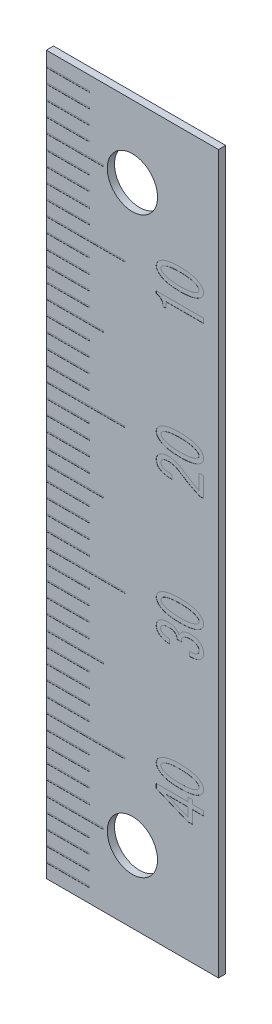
from build123d import *

# Parameters (mm, degrees)
SKETCH1_W      = 12
SKETCH1_H      = 50
EXTRUDE1_DEPTH = 0.5
SKETCH2_R      = 1.75
EXTRUDE2_DEPTH = 52.42227144
EXTRUDE3_DEPTH = 0.01
SKETCH4_W      = 3
SKETCH4_H      = 0.1
SKETCH4_W_2    = 4
SKETCH4_W_3    = 5.5
EXTRUDE4_DEPTH = 0.01


with BuildPart() as part:
    # Sketch1 → Extrude1 (new body)
    with BuildSketch(Plane.XY):
        with Locations((6, 25)):
            Rectangle(SKETCH1_W, SKETCH1_H)
    extrude(amount=EXTRUDE1_DEPTH)

    # Sketch2 → Extrude2 (cut, through all)
    with BuildSketch(Plane.XY.offset(0.5)):
        with Locations((6, 5)):
            Circle(SKETCH2_R)
        with Locations((6, 45)):
            Circle(SKETCH2_R)
    extrude(amount=-EXTRUDE2_DEPTH, mode=Mode.SUBTRACT)

    # Sketch3 → Extrude3 (cut)
    # profile 1 of 8: a face of its own
    with BuildSketch(Plane.XY.offset(0.5)):
        with BuildLine():
            Line((10.964202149, 38.983541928), (9.643449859, 38.983541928))
            Line((9.643449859, 38.983541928), (8.334630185, 38.983541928))
            Line((8.334630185, 38.983541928), (8.334630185, 38.58788147))
            Line((8.334630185, 38.58788147), (8.134287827, 38.58788147))
            add(Edge.make_bspline(
                [(8.134287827, 38.58788147), (8.133949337, 38.607154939), (8.133292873, 38.644533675), (8.127537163, 38.699138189), (8.117992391, 38.750485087), (8.105914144, 38.79930573), (8.088535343, 38.844454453), (8.068559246, 38.887235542), (8.044100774, 38.926478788), (8.016032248, 38.962796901), (7.984633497, 38.996211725), (7.949221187, 39.026469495), (7.910057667, 39.053561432), (7.867120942, 39.077453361), (7.820438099, 39.09818504), (7.770182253, 39.115604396), (7.716225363, 39.130205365), (7.67880858, 39.137442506), (7.659495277, 39.141178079)],
                knots=[0, 0, 0, 0, 1.144858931, 2.220325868, 3.257124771, 4.246590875, 5.202985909, 6.126465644, 7.048017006, 7.94360395, 8.849836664, 9.767181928, 10.705616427, 11.674465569, 12.68221077, 13.736395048, 14.831602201, 16, 16, 16, 16], degree=3))
            Line((7.659495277, 39.141178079), (7.659495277, 39.303210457))
            Line((7.659495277, 39.303210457), (10.964202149, 39.303210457))
            Line((10.964202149, 39.303210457), (10.964202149, 38.983541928))
        make_face()
    # profile 2 of 8: a face of its own
    with BuildSketch(Plane.XY.offset(0.5)):
        with BuildLine():
            add(Edge.make_bspline(
                [(9.304312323, 40.08636695), (9.263487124, 40.086598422), (9.183284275, 40.087053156), (9.065184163, 40.090916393), (8.951677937, 40.097059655), (8.842790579, 40.105920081), (8.738418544, 40.116877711), (8.638826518, 40.131643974), (8.543659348, 40.147711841), (8.453367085, 40.166540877), (8.367534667, 40.187646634), (8.286660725, 40.212475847), (8.209981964, 40.238496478), (8.13792646, 40.267351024), (8.071052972, 40.299483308), (8.008231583, 40.333293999), (7.950513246, 40.370357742), (7.914537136, 40.397244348), (7.896891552, 40.410431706)],
                knots=[0, 0, 0, 0, 1.334199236, 2.621091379, 3.861325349, 5.048806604, 6.191184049, 7.29033474, 8.338632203, 9.344988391, 10.304094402, 11.226124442, 12.10888774, 12.949942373, 13.760906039, 14.53244093, 15.280190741, 16, 16, 16, 16], degree=3))
            add(Edge.make_bspline(
                [(7.896891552, 40.410431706), (7.877886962, 40.425936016), (7.841081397, 40.455962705), (7.793642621, 40.506288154), (7.75209867, 40.556343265), (7.718531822, 40.608467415), (7.691781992, 40.661574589), (7.673561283, 40.716630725), (7.661657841, 40.77250316), (7.660214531, 40.810429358), (7.659495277, 40.829329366)],
                knots=[0, 0, 0, 0, 1.179273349, 2.283859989, 3.322502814, 4.306324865, 5.261663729, 6.17616916, 7.091118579, 8, 8, 8, 8], degree=3))
            add(Edge.make_bspline(
                [(7.659495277, 40.829329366), (7.660212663, 40.848230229), (7.661652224, 40.886158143), (7.67358392, 40.942017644), (7.691636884, 40.996945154), (7.718688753, 41.049705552), (7.752296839, 41.101723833), (7.793217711, 41.152330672), (7.841340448, 41.202029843), (7.877935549, 41.232049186), (7.896891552, 41.247598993)],
                knots=[0, 0, 0, 0, 0.909839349, 1.825753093, 2.741222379, 3.688535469, 4.673394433, 5.720979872, 6.819483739, 8, 8, 8, 8], degree=3))
            add(Edge.make_bspline(
                [(7.896891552, 41.247598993), (7.914537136, 41.260786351), (7.950513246, 41.287672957), (8.008231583, 41.3247367), (8.071052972, 41.358547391), (8.13792646, 41.390679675), (8.209981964, 41.419534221), (8.286660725, 41.445554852), (8.367534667, 41.470384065), (8.453367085, 41.491489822), (8.543659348, 41.510318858), (8.638826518, 41.526386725), (8.738418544, 41.541152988), (8.842790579, 41.552110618), (8.951677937, 41.560971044), (9.065184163, 41.567114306), (9.183284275, 41.570977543), (9.263487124, 41.571432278), (9.304312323, 41.571663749)],
                knots=[0, 0, 0, 0, 0.719809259, 1.46755907, 2.239093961, 3.050057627, 3.89111226, 4.773875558, 5.695905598, 6.655011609, 7.661367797, 8.70966526, 9.808815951, 10.951193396, 12.138674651, 13.378908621, 14.665800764, 16, 16, 16, 16], degree=3))
            add(Edge.make_bspline(
                [(9.304312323, 41.571663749), (9.345974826, 41.571432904), (9.427642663, 41.570980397), (9.547627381, 41.567132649), (9.662805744, 41.560946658), (9.773365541, 41.552091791), (9.879218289, 41.541255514), (9.980042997, 41.52631378), (10.076267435, 41.510328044), (10.167806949, 41.49146689), (10.25471717, 41.470480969), (10.336402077, 41.445542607), (10.413707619, 41.419531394), (10.486394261, 41.390685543), (10.553875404, 41.358519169), (10.617234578, 41.324907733), (10.675058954, 41.28765614), (10.711041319, 41.260780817), (10.728689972, 41.247598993)],
                knots=[0, 0, 0, 0, 1.346341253, 2.639130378, 3.8790076, 5.073442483, 6.223226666, 7.316783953, 8.366697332, 9.375051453, 10.336565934, 11.254764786, 12.134057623, 12.971986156, 13.779994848, 14.548849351, 15.288238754, 16, 16, 16, 16], degree=3))
            add(Edge.make_bspline(
                [(10.728689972, 41.247598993), (10.747351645, 41.231964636), (10.783604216, 41.201592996), (10.832476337, 41.152791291), (10.872490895, 41.101447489), (10.906527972, 41.049937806), (10.932289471, 40.996615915), (10.951811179, 40.942259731), (10.962410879, 40.886054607), (10.964024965, 40.848209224), (10.964830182, 40.829329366)],
                knots=[0, 0, 0, 0, 1.1743338, 2.28128622, 3.323893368, 4.309986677, 5.254013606, 6.173907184, 7.08902033, 8, 8, 8, 8], degree=3))
            add(Edge.make_bspline(
                [(10.964830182, 40.829329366), (10.964023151, 40.81045032), (10.962405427, 40.772606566), (10.95183315, 40.716389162), (10.932141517, 40.661902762), (10.906685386, 40.608236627), (10.872691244, 40.556620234), (10.832051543, 40.505827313), (10.783860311, 40.456400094), (10.747399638, 40.426020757), (10.728689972, 40.410431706)],
                knots=[0, 0, 0, 0, 0.910025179, 1.824179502, 2.743109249, 3.69522398, 4.680284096, 5.713901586, 6.826896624, 8, 8, 8, 8], degree=3))
            add(Edge.make_bspline(
                [(10.728689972, 40.410431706), (10.711041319, 40.397249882), (10.675058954, 40.370374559), (10.617234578, 40.333122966), (10.553875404, 40.29951153), (10.486394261, 40.267345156), (10.413707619, 40.238499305), (10.336402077, 40.212488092), (10.25471717, 40.18754973), (10.167806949, 40.166563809), (10.076267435, 40.147702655), (9.980042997, 40.131716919), (9.879218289, 40.116775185), (9.773365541, 40.105938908), (9.662805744, 40.097084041), (9.547627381, 40.09089805), (9.427642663, 40.087050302), (9.345974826, 40.086597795), (9.304312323, 40.08636695)],
                knots=[0, 0, 0, 0, 0.711761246, 1.451150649, 2.220005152, 3.028013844, 3.865942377, 4.745235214, 5.663434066, 6.624948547, 7.633302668, 8.683216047, 9.776773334, 10.926557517, 12.1209924, 13.360869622, 14.653658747, 16, 16, 16, 16], degree=3))
        make_face()
        with BuildLine():
            add(Edge.make_bspline(
                [(9.304312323, 41.261415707), (9.267676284, 41.261069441), (9.195861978, 41.260390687), (9.090316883, 41.258165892), (8.989150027, 41.253278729), (8.892481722, 41.245290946), (8.80022693, 41.237179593), (8.712814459, 41.225295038), (8.629718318, 41.213328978), (8.551258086, 41.197943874), (8.47692929, 41.181420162), (8.407398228, 41.16150603), (8.341873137, 41.141413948), (8.281453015, 41.117852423), (8.225379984, 41.092883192), (8.173815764, 41.065786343), (8.126168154, 41.037204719), (8.097468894, 41.015283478), (8.083417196, 41.004550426)],
                knots=[0, 0, 0, 0, 1.387476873, 2.71974516, 3.997715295, 5.222316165, 6.392993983, 7.5041764, 8.562605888, 9.571696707, 10.531368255, 11.445041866, 12.310057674, 13.125709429, 13.899281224, 14.633331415, 15.330853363, 16, 16, 16, 16], degree=3))
            add(Edge.make_bspline(
                [(8.083417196, 41.004550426), (8.067942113, 40.991309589), (8.038992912, 40.966539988), (8.006840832, 40.922559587), (7.985224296, 40.87705391), (7.982844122, 40.845041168), (7.981675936, 40.829329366)],
                knots=[0, 0, 0, 0, 1.162721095, 2.175099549, 3.10434177, 4, 4, 4, 4], degree=3))
            add(Edge.make_bspline(
                [(7.981675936, 40.829329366), (7.982836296, 40.813611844), (7.985200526, 40.781587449), (8.007018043, 40.736019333), (8.038753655, 40.691521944), (8.067903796, 40.666693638), (8.083417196, 40.653480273)],
                knots=[0, 0, 0, 0, 0.893494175, 1.820491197, 2.840088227, 4, 4, 4, 4], degree=3))
            add(Edge.make_bspline(
                [(8.083417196, 40.653480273), (8.098156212, 40.643035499), (8.128454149, 40.621564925), (8.177291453, 40.592299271), (8.230299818, 40.565060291), (8.287887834, 40.540907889), (8.349363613, 40.517529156), (8.415145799, 40.496237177), (8.485227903, 40.477516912), (8.559390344, 40.460570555), (8.637959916, 40.445608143), (8.720652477, 40.432335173), (8.807623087, 40.421817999), (8.898748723, 40.413272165), (8.994176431, 40.405404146), (9.093874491, 40.400498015), (9.197746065, 40.398267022), (9.268304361, 40.397589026), (9.304312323, 40.397243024)],
                knots=[0, 0, 0, 0, 0.684573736, 1.407229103, 2.156074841, 2.941731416, 3.772993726, 4.648817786, 5.561264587, 6.521855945, 7.531913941, 8.592575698, 9.69595549, 10.851956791, 12.06190895, 13.325252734, 14.634998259, 16, 16, 16, 16], degree=3))
            add(Edge.make_bspline(
                [(9.304312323, 40.397243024), (9.341785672, 40.397588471), (9.415065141, 40.398263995), (9.522703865, 40.400490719), (9.625541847, 40.405385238), (9.723691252, 40.413273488), (9.817323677, 40.421841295), (9.906404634, 40.432229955), (9.990753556, 40.445635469), (10.070391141, 40.460491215), (10.145369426, 40.477539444), (10.215901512, 40.496147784), (10.281702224, 40.517419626), (10.342729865, 40.540898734), (10.399661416, 40.565104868), (10.451853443, 40.591966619), (10.49904188, 40.621590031), (10.528053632, 40.643045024), (10.542164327, 40.653480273)],
                knots=[0, 0, 0, 0, 1.401046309, 2.739758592, 4.0248449, 5.249399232, 6.420696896, 7.540008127, 8.601571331, 9.613140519, 10.568176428, 11.475655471, 12.339456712, 13.151990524, 13.919674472, 14.651282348, 15.344012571, 16, 16, 16, 16], degree=3))
            add(Edge.make_bspline(
                [(10.542164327, 40.653480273), (10.557596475, 40.666746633), (10.586687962, 40.691755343), (10.619429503, 40.735654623), (10.640196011, 40.781762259), (10.642682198, 40.813642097), (10.643905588, 40.829329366)],
                knots=[0, 0, 0, 0, 1.159232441, 2.18529495, 3.107029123, 4, 4, 4, 4], degree=3))
            add(Edge.make_bspline(
                [(10.643905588, 40.829329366), (10.642674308, 40.845010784), (10.640172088, 40.876878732), (10.619603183, 40.922925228), (10.586449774, 40.966304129), (10.557558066, 40.991255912), (10.542164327, 41.004550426)],
                knots=[0, 0, 0, 0, 0.89511734, 1.819067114, 2.837981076, 4, 4, 4, 4], degree=3))
            add(Edge.make_bspline(
                [(10.542164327, 41.004550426), (10.528109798, 41.015278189), (10.499404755, 41.037188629), (10.45164342, 41.065951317), (10.399548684, 41.092855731), (10.342868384, 41.117856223), (10.281814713, 41.14140776), (10.215668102, 41.161504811), (10.14550559, 41.181409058), (10.070358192, 41.198018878), (9.990830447, 41.213306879), (9.906283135, 41.225349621), (9.817389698, 41.237124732), (9.72367965, 41.245296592), (9.625545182, 41.253298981), (9.522702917, 41.258160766), (9.415065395, 41.26039668), (9.341785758, 41.261070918), (9.304312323, 41.261415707)],
                knots=[0, 0, 0, 0, 0.660466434, 1.348940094, 2.080407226, 2.851088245, 3.663465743, 4.524722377, 5.434082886, 6.388935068, 7.400309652, 8.46048529, 9.580538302, 10.751610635, 11.975929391, 13.260768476, 14.599223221, 16, 16, 16, 16], degree=3))
        make_face(mode=Mode.SUBTRACT)
    # profile 3 of 8: a face of its own
    with BuildSketch(Plane.XY.offset(0.5)):
        with BuildLine():
            Line((10.643905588, 29.789307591), (10.964830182, 29.789307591))
            Line((10.964830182, 29.789307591), (10.964830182, 28.412032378))
            Line((10.964830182, 28.412032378), (10.694776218, 28.412032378))
            add(Edge.make_bspline(
                [(10.694776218, 28.412032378), (10.634104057, 28.438239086), (10.512820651, 28.490626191), (10.333941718, 28.576059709), (10.15666089, 28.664824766), (9.982086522, 28.759401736), (9.809323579, 28.858008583), (9.638392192, 28.960822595), (9.469988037, 29.068963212), (9.359615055, 29.144268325), (9.304312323, 29.18200019)],
                knots=[0, 0, 0, 0, 0.99614483, 1.991289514, 2.987624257, 3.984438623, 4.983697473, 5.985971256, 6.990864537, 8, 8, 8, 8], degree=3))
            add(Edge.make_bspline(
                [(9.304312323, 29.18200019), (9.273407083, 29.202561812), (9.212458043, 29.24311193), (9.117211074, 29.295150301), (9.021104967, 29.339278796), (8.923672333, 29.375332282), (8.825440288, 29.4035815), (8.72593849, 29.42388529), (8.625513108, 29.436178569), (8.558034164, 29.437551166), (8.524295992, 29.438237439)],
                knots=[0, 0, 0, 0, 1.067918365, 2.106070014, 3.119789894, 4.109153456, 5.093164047, 6.058534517, 7.029304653, 8, 8, 8, 8], degree=3))
            add(Edge.make_bspline(
                [(8.524295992, 29.438237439), (8.501046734, 29.437894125), (8.455732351, 29.437224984), (8.389860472, 29.431518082), (8.328132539, 29.422267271), (8.270797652, 29.409104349), (8.21743613, 29.392320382), (8.168710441, 29.370724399), (8.123431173, 29.346637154), (8.096599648, 29.326782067), (8.083417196, 29.317027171)],
                knots=[0, 0, 0, 0, 1.197973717, 2.334932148, 3.404529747, 4.412096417, 5.3640046, 6.281988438, 7.155932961, 8, 8, 8, 8], degree=3))
            add(Edge.make_bspline(
                [(8.083417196, 29.317027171), (8.067746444, 29.303076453), (8.037248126, 29.275925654), (8.005254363, 29.223199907), (7.984772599, 29.164442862), (7.982726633, 29.122515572), (7.981675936, 29.100984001)],
                knots=[0, 0, 0, 0, 1.01321699, 1.971916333, 2.958486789, 4, 4, 4, 4], degree=3))
            add(Edge.make_bspline(
                [(7.981675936, 29.100984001), (7.983585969, 29.082717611), (7.987575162, 29.044567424), (8.01537348, 28.988943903), (8.059276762, 28.934674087), (8.097036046, 28.902326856), (8.11733095, 28.88494083)],
                knots=[0, 0, 0, 0, 0.831770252, 1.737190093, 2.783782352, 4, 4, 4, 4], degree=3))
            add(Edge.make_bspline(
                [(8.11733095, 28.88494083), (8.13152823, 28.875101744), (8.161915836, 28.854042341), (8.215884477, 28.829594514), (8.27953563, 28.808918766), (8.353234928, 28.792609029), (8.436819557, 28.778578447), (8.530630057, 28.769762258), (8.63433812, 28.764032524), (8.706835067, 28.763421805), (8.74473539, 28.76310253)],
                knots=[0, 0, 0, 0, 0.638255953, 1.36611168, 2.182006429, 3.11234378, 4.156826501, 5.317109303, 6.597424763, 8, 8, 8, 8], degree=3))
            Line((8.74473539, 28.76310253), (8.74473539, 28.466043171))
            add(Edge.make_bspline(
                [(8.74473539, 28.466043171), (8.695515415, 28.46790543), (8.600702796, 28.471492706), (8.463728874, 28.483794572), (8.337426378, 28.503038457), (8.221668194, 28.528812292), (8.116016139, 28.559516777), (8.021404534, 28.598268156), (7.936291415, 28.64179784), (7.886844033, 28.67828985), (7.862977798, 28.695903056)],
                knots=[0, 0, 0, 0, 1.276449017, 2.458828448, 3.562299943, 4.585123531, 5.530965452, 6.409552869, 7.23235602, 8, 8, 8, 8], degree=3))
            add(Edge.make_bspline(
                [(7.862977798, 28.695903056), (7.846729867, 28.709564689), (7.814699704, 28.736496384), (7.773183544, 28.782576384), (7.738532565, 28.832204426), (7.708926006, 28.884437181), (7.687412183, 28.940944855), (7.67065538, 29.000105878), (7.661233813, 29.063001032), (7.660084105, 29.105978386), (7.659495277, 29.127989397)],
                knots=[0, 0, 0, 0, 1.027969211, 2.026474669, 2.994832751, 3.957646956, 4.927969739, 5.917517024, 6.933448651, 8, 8, 8, 8], degree=3))
            add(Edge.make_bspline(
                [(7.659495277, 29.127989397), (7.659956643, 29.148979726), (7.660867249, 29.190408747), (7.672379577, 29.250967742), (7.688861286, 29.309450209), (7.71397118, 29.364787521), (7.74481477, 29.418042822), (7.782906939, 29.468678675), (7.828294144, 29.516390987), (7.862484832, 29.545314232), (7.879934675, 29.560075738)],
                knots=[0, 0, 0, 0, 1.000230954, 1.974175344, 2.932001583, 3.893571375, 4.865053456, 5.864036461, 6.909871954, 8, 8, 8, 8], degree=3))
            add(Edge.make_bspline(
                [(7.879934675, 29.560075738), (7.900321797, 29.575446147), (7.941611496, 29.606575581), (8.010569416, 29.644342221), (8.084899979, 29.676515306), (8.164800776, 29.703727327), (8.25083857, 29.724143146), (8.34261768, 29.738396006), (8.43996472, 29.747294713), (8.506900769, 29.748496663), (8.541252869, 29.749113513)],
                knots=[0, 0, 0, 0, 0.873404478, 1.768891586, 2.683909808, 3.645167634, 4.655436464, 5.707963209, 6.823708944, 8, 8, 8, 8], degree=3))
            add(Edge.make_bspline(
                [(8.541252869, 29.749113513), (8.5825466, 29.747997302), (8.665684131, 29.745750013), (8.7908176, 29.728176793), (8.916613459, 29.69873904), (9.043909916, 29.659401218), (9.171696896, 29.607206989), (9.300597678, 29.544064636), (9.430892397, 29.470149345), (9.515481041, 29.41326659), (9.558665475, 29.384226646)],
                knots=[0, 0, 0, 0, 0.902713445, 1.817451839, 2.756860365, 3.725448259, 4.727634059, 5.771721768, 6.862413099, 8, 8, 8, 8], degree=3))
            add(Edge.make_bspline(
                [(9.558665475, 29.384226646), (9.650692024, 29.32107194), (9.831341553, 29.197098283), (10.105692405, 29.027797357), (10.37414261, 28.87223849), (10.555117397, 28.780905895), (10.643905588, 28.736097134)],
                knots=[0, 0, 0, 0, 1.058433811, 2.077721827, 3.056909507, 4, 4, 4, 4], degree=3))
            Line((10.643905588, 28.736097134), (10.643905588, 29.789307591))
        make_face()
    # profile 4 of 8: a face of its own
    with BuildSketch(Plane.XY.offset(0.5)):
        with BuildLine():
            add(Edge.make_bspline(
                [(9.304312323, 30.08636695), (9.263487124, 30.086598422), (9.183284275, 30.087053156), (9.065184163, 30.090916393), (8.951677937, 30.097059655), (8.842790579, 30.105920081), (8.738418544, 30.116877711), (8.638826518, 30.131643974), (8.543659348, 30.147711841), (8.453367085, 30.166540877), (8.367534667, 30.187646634), (8.286660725, 30.212475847), (8.209981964, 30.238496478), (8.13792646, 30.267351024), (8.071052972, 30.299483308), (8.008231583, 30.333293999), (7.950513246, 30.370357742), (7.914537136, 30.397244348), (7.896891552, 30.410431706)],
                knots=[0, 0, 0, 0, 1.334199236, 2.621091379, 3.861325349, 5.048806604, 6.191184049, 7.29033474, 8.338632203, 9.344988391, 10.304094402, 11.226124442, 12.10888774, 12.949942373, 13.760906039, 14.53244093, 15.280190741, 16, 16, 16, 16], degree=3))
            add(Edge.make_bspline(
                [(7.896891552, 30.410431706), (7.877886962, 30.425936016), (7.841081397, 30.455962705), (7.793642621, 30.506288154), (7.75209867, 30.556343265), (7.718531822, 30.608467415), (7.691781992, 30.661574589), (7.673561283, 30.716630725), (7.661657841, 30.77250316), (7.660214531, 30.810429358), (7.659495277, 30.829329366)],
                knots=[0, 0, 0, 0, 1.179273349, 2.283859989, 3.322502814, 4.306324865, 5.261663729, 6.17616916, 7.091118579, 8, 8, 8, 8], degree=3))
            add(Edge.make_bspline(
                [(7.659495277, 30.829329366), (7.660212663, 30.848230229), (7.661652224, 30.886158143), (7.67358392, 30.942017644), (7.691636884, 30.996945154), (7.718688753, 31.049705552), (7.752296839, 31.101723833), (7.793217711, 31.152330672), (7.841340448, 31.202029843), (7.877935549, 31.232049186), (7.896891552, 31.247598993)],
                knots=[0, 0, 0, 0, 0.909839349, 1.825753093, 2.741222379, 3.688535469, 4.673394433, 5.720979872, 6.819483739, 8, 8, 8, 8], degree=3))
            add(Edge.make_bspline(
                [(7.896891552, 31.247598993), (7.914537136, 31.260786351), (7.950513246, 31.287672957), (8.008231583, 31.3247367), (8.071052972, 31.358547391), (8.13792646, 31.390679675), (8.209981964, 31.419534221), (8.286660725, 31.445554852), (8.367534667, 31.470384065), (8.453367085, 31.491489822), (8.543659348, 31.510318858), (8.638826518, 31.526386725), (8.738418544, 31.541152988), (8.842790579, 31.552110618), (8.951677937, 31.560971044), (9.065184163, 31.567114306), (9.183284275, 31.570977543), (9.263487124, 31.571432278), (9.304312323, 31.571663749)],
                knots=[0, 0, 0, 0, 0.719809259, 1.46755907, 2.239093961, 3.050057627, 3.89111226, 4.773875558, 5.695905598, 6.655011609, 7.661367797, 8.70966526, 9.808815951, 10.951193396, 12.138674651, 13.378908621, 14.665800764, 16, 16, 16, 16], degree=3))
            add(Edge.make_bspline(
                [(9.304312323, 31.571663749), (9.345974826, 31.571432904), (9.427642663, 31.570980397), (9.547627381, 31.567132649), (9.662805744, 31.560946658), (9.773365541, 31.552091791), (9.879218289, 31.541255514), (9.980042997, 31.52631378), (10.076267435, 31.510328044), (10.167806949, 31.49146689), (10.25471717, 31.470480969), (10.336402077, 31.445542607), (10.413707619, 31.419531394), (10.486394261, 31.390685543), (10.553875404, 31.358519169), (10.617234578, 31.324907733), (10.675058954, 31.28765614), (10.711041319, 31.260780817), (10.728689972, 31.247598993)],
                knots=[0, 0, 0, 0, 1.346341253, 2.639130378, 3.8790076, 5.073442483, 6.223226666, 7.316783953, 8.366697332, 9.375051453, 10.336565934, 11.254764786, 12.134057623, 12.971986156, 13.779994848, 14.548849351, 15.288238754, 16, 16, 16, 16], degree=3))
            add(Edge.make_bspline(
                [(10.728689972, 31.247598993), (10.747351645, 31.231964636), (10.783604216, 31.201592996), (10.832476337, 31.152791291), (10.872490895, 31.101447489), (10.906527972, 31.049937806), (10.932289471, 30.996615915), (10.951811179, 30.942259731), (10.962410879, 30.886054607), (10.964024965, 30.848209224), (10.964830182, 30.829329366)],
                knots=[0, 0, 0, 0, 1.1743338, 2.28128622, 3.323893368, 4.309986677, 5.254013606, 6.173907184, 7.08902033, 8, 8, 8, 8], degree=3))
            add(Edge.make_bspline(
                [(10.964830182, 30.829329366), (10.964023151, 30.81045032), (10.962405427, 30.772606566), (10.95183315, 30.716389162), (10.932141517, 30.661902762), (10.906685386, 30.608236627), (10.872691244, 30.556620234), (10.832051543, 30.505827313), (10.783860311, 30.456400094), (10.747399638, 30.426020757), (10.728689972, 30.410431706)],
                knots=[0, 0, 0, 0, 0.910025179, 1.824179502, 2.743109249, 3.69522398, 4.680284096, 5.713901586, 6.826896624, 8, 8, 8, 8], degree=3))
            add(Edge.make_bspline(
                [(10.728689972, 30.410431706), (10.711041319, 30.397249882), (10.675058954, 30.370374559), (10.617234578, 30.333122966), (10.553875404, 30.29951153), (10.486394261, 30.267345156), (10.413707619, 30.238499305), (10.336402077, 30.212488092), (10.25471717, 30.18754973), (10.167806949, 30.166563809), (10.076267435, 30.147702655), (9.980042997, 30.131716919), (9.879218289, 30.116775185), (9.773365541, 30.105938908), (9.662805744, 30.097084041), (9.547627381, 30.09089805), (9.427642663, 30.087050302), (9.345974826, 30.086597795), (9.304312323, 30.08636695)],
                knots=[0, 0, 0, 0, 0.711761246, 1.451150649, 2.220005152, 3.028013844, 3.865942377, 4.745235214, 5.663434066, 6.624948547, 7.633302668, 8.683216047, 9.776773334, 10.926557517, 12.1209924, 13.360869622, 14.653658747, 16, 16, 16, 16], degree=3))
        make_face()
        with BuildLine():
            add(Edge.make_bspline(
                [(9.304312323, 31.261415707), (9.267676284, 31.261069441), (9.195861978, 31.260390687), (9.090316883, 31.258165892), (8.989150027, 31.253278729), (8.892481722, 31.245290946), (8.80022693, 31.237179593), (8.712814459, 31.225295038), (8.629718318, 31.213328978), (8.551258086, 31.197943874), (8.47692929, 31.181420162), (8.407398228, 31.16150603), (8.341873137, 31.141413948), (8.281453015, 31.117852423), (8.225379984, 31.092883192), (8.173815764, 31.065786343), (8.126168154, 31.037204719), (8.097468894, 31.015283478), (8.083417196, 31.004550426)],
                knots=[0, 0, 0, 0, 1.387476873, 2.71974516, 3.997715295, 5.222316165, 6.392993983, 7.5041764, 8.562605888, 9.571696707, 10.531368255, 11.445041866, 12.310057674, 13.125709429, 13.899281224, 14.633331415, 15.330853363, 16, 16, 16, 16], degree=3))
            add(Edge.make_bspline(
                [(8.083417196, 31.004550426), (8.067942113, 30.991309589), (8.038992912, 30.966539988), (8.006840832, 30.922559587), (7.985224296, 30.87705391), (7.982844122, 30.845041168), (7.981675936, 30.829329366)],
                knots=[0, 0, 0, 0, 1.162721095, 2.175099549, 3.10434177, 4, 4, 4, 4], degree=3))
            add(Edge.make_bspline(
                [(7.981675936, 30.829329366), (7.982836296, 30.813611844), (7.985200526, 30.781587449), (8.007018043, 30.736019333), (8.038753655, 30.691521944), (8.067903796, 30.666693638), (8.083417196, 30.653480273)],
                knots=[0, 0, 0, 0, 0.893494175, 1.820491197, 2.840088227, 4, 4, 4, 4], degree=3))
            add(Edge.make_bspline(
                [(8.083417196, 30.653480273), (8.098156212, 30.643035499), (8.128454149, 30.621564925), (8.177291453, 30.592299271), (8.230299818, 30.565060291), (8.287887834, 30.540907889), (8.349363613, 30.517529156), (8.415145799, 30.496237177), (8.485227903, 30.477516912), (8.559390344, 30.460570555), (8.637959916, 30.445608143), (8.720652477, 30.432335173), (8.807623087, 30.421817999), (8.898748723, 30.413272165), (8.994176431, 30.405404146), (9.093874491, 30.400498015), (9.197746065, 30.398267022), (9.268304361, 30.397589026), (9.304312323, 30.397243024)],
                knots=[0, 0, 0, 0, 0.684573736, 1.407229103, 2.156074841, 2.941731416, 3.772993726, 4.648817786, 5.561264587, 6.521855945, 7.531913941, 8.592575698, 9.69595549, 10.851956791, 12.06190895, 13.325252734, 14.634998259, 16, 16, 16, 16], degree=3))
            add(Edge.make_bspline(
                [(9.304312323, 30.397243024), (9.341785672, 30.397588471), (9.415065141, 30.398263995), (9.522703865, 30.400490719), (9.625541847, 30.405385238), (9.723691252, 30.413273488), (9.817323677, 30.421841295), (9.906404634, 30.432229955), (9.990753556, 30.445635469), (10.070391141, 30.460491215), (10.145369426, 30.477539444), (10.215901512, 30.496147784), (10.281702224, 30.517419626), (10.342729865, 30.540898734), (10.399661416, 30.565104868), (10.451853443, 30.591966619), (10.49904188, 30.621590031), (10.528053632, 30.643045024), (10.542164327, 30.653480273)],
                knots=[0, 0, 0, 0, 1.401046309, 2.739758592, 4.0248449, 5.249399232, 6.420696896, 7.540008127, 8.601571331, 9.613140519, 10.568176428, 11.475655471, 12.339456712, 13.151990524, 13.919674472, 14.651282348, 15.344012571, 16, 16, 16, 16], degree=3))
            add(Edge.make_bspline(
                [(10.542164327, 30.653480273), (10.557596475, 30.666746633), (10.586687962, 30.691755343), (10.619429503, 30.735654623), (10.640196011, 30.781762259), (10.642682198, 30.813642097), (10.643905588, 30.829329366)],
                knots=[0, 0, 0, 0, 1.159232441, 2.18529495, 3.107029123, 4, 4, 4, 4], degree=3))
            add(Edge.make_bspline(
                [(10.643905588, 30.829329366), (10.642674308, 30.845010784), (10.640172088, 30.876878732), (10.619603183, 30.922925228), (10.586449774, 30.966304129), (10.557558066, 30.991255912), (10.542164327, 31.004550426)],
                knots=[0, 0, 0, 0, 0.89511734, 1.819067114, 2.837981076, 4, 4, 4, 4], degree=3))
            add(Edge.make_bspline(
                [(10.542164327, 31.004550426), (10.528109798, 31.015278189), (10.499404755, 31.037188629), (10.45164342, 31.065951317), (10.399548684, 31.092855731), (10.342868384, 31.117856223), (10.281814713, 31.14140776), (10.215668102, 31.161504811), (10.14550559, 31.181409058), (10.070358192, 31.198018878), (9.990830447, 31.213306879), (9.906283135, 31.225349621), (9.817389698, 31.237124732), (9.72367965, 31.245296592), (9.625545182, 31.253298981), (9.522702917, 31.258160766), (9.415065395, 31.26039668), (9.341785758, 31.261070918), (9.304312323, 31.261415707)],
                knots=[0, 0, 0, 0, 0.660466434, 1.348940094, 2.080407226, 2.851088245, 3.663465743, 4.524722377, 5.434082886, 6.388935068, 7.400309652, 8.46048529, 9.580538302, 10.751610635, 11.975929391, 13.260768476, 14.599223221, 16, 16, 16, 16], degree=3))
        make_face(mode=Mode.SUBTRACT)
    # profile 5 of 8: a face of its own
    with BuildSketch(Plane.XY.offset(0.5)):
        with BuildLine():
            add(Edge.make_bspline(
                [(9.982587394, 18.709091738), (10.012525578, 18.708287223), (10.070543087, 18.706728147), (10.154420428, 18.710760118), (10.232130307, 18.718455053), (10.303298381, 18.73168567), (10.368273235, 18.749141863), (10.427053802, 18.770782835), (10.479378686, 18.79791141), (10.510164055, 18.820091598), (10.525207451, 18.830930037)],
                knots=[0, 0, 0, 0, 1.267087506, 2.455501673, 3.55133733, 4.569646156, 5.515332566, 6.395721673, 7.21606285, 8, 8, 8, 8], degree=3))
            add(Edge.make_bspline(
                [(10.525207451, 18.830930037), (10.543506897, 18.847280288), (10.579345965, 18.8793019), (10.617183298, 18.941459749), (10.639871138, 19.011713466), (10.642530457, 19.061449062), (10.643905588, 19.087167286)],
                knots=[0, 0, 0, 0, 1.002413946, 1.963205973, 2.946775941, 4, 4, 4, 4], degree=3))
            add(Edge.make_bspline(
                [(10.643905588, 19.087167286), (10.64205895, 19.10966892), (10.638250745, 19.15607263), (10.60631016, 19.222801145), (10.557507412, 19.287350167), (10.514319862, 19.324320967), (10.491293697, 19.344032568)],
                knots=[0, 0, 0, 0, 0.87119639, 1.796613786, 2.82522778, 4, 4, 4, 4], degree=3))
            add(Edge.make_bspline(
                [(10.491293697, 19.344032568), (10.477715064, 19.35383947), (10.449615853, 19.374133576), (10.40102721, 19.398039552), (10.347048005, 19.41973801), (10.286272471, 19.436247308), (10.219328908, 19.449449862), (10.146079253, 19.458528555), (10.066417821, 19.464292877), (10.011278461, 19.464917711), (9.982587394, 19.465242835)],
                knots=[0, 0, 0, 0, 0.754595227, 1.561536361, 2.43511806, 3.377163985, 4.397951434, 5.512234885, 6.705522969, 8, 8, 8, 8], degree=3))
            add(Edge.make_bspline(
                [(9.982587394, 19.465242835), (9.960377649, 19.46473344), (9.916687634, 19.463731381), (9.85267071, 19.456647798), (9.791236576, 19.44559945), (9.732735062, 19.428991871), (9.676430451, 19.40846888), (9.623062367, 19.382368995), (9.571883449, 19.352579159), (9.540443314, 19.328863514), (9.524751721, 19.317027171)],
                knots=[0, 0, 0, 0, 1.086352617, 2.137024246, 3.147391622, 4.136355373, 5.10847195, 6.074961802, 7.039224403, 8, 8, 8, 8], degree=3))
            add(Edge.make_bspline(
                [(9.524751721, 19.317027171), (9.514022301, 19.307663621), (9.492758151, 19.289106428), (9.465670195, 19.256771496), (9.44319759, 19.221167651), (9.426529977, 19.181802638), (9.413593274, 19.139332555), (9.406578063, 19.093273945), (9.403067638, 19.044064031), (9.405038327, 19.010337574), (9.406053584, 18.992962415)],
                knots=[0, 0, 0, 0, 0.947861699, 1.87852391, 2.799832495, 3.743268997, 4.71875736, 5.750864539, 6.841292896, 8, 8, 8, 8], degree=3))
            Line((9.406053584, 18.992962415), (9.117786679, 18.992962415))
            add(Edge.make_bspline(
                [(9.117786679, 18.992962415), (9.115917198, 19.01036469), (9.11227151, 19.044300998), (9.103170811, 19.09366086), (9.089082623, 19.139312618), (9.072365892, 19.182135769), (9.050836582, 19.220887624), (9.026138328, 19.256550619), (8.997813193, 19.288974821), (8.976089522, 19.307646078), (8.965174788, 19.317027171)],
                knots=[0, 0, 0, 0, 1.139052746, 2.221275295, 3.260086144, 4.244297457, 5.207730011, 6.137529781, 7.064229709, 8, 8, 8, 8], degree=3))
            add(Edge.make_bspline(
                [(8.965174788, 19.317027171), (8.953430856, 19.325692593), (8.929384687, 19.343435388), (8.888683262, 19.365118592), (8.844024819, 19.38418922), (8.794826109, 19.398815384), (8.741812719, 19.411043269), (8.684417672, 19.41879032), (8.62278159, 19.423939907), (8.580202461, 19.42467109), (8.558209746, 19.425048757)],
                knots=[0, 0, 0, 0, 0.816014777, 1.670822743, 2.574059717, 3.530392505, 4.539613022, 5.616822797, 6.769055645, 8, 8, 8, 8], degree=3))
            add(Edge.make_bspline(
                [(8.558209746, 19.425048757), (8.530985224, 19.424710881), (8.478357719, 19.424057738), (8.402231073, 19.418395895), (8.331762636, 19.409047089), (8.266898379, 19.396390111), (8.208285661, 19.3784051), (8.154956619, 19.358063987), (8.10766056, 19.33316966), (8.079858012, 19.312952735), (8.06646032, 19.303210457)],
                knots=[0, 0, 0, 0, 1.267211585, 2.44963652, 3.550842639, 4.575246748, 5.5217347, 6.401234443, 7.229575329, 8, 8, 8, 8], degree=3))
            add(Edge.make_bspline(
                [(8.06646032, 19.303210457), (8.050800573, 19.289680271), (8.020516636, 19.263514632), (7.989112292, 19.21338768), (7.967772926, 19.159180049), (7.965751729, 19.120663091), (7.964719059, 19.100984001)],
                knots=[0, 0, 0, 0, 1.053722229, 2.037763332, 2.997453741, 4, 4, 4, 4], degree=3))
            add(Edge.make_bspline(
                [(7.964719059, 19.100984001), (7.965793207, 19.081323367), (7.967906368, 19.0426452), (7.988749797, 18.988170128), (8.020925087, 18.938367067), (8.050860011, 18.911914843), (8.06646032, 18.898129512)],
                knots=[0, 0, 0, 0, 1.000412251, 1.968100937, 2.94109465, 4, 4, 4, 4], degree=3))
            add(Edge.make_bspline(
                [(8.06646032, 18.898129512), (8.081277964, 18.887055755), (8.111428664, 18.864523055), (8.162612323, 18.837488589), (8.218046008, 18.812216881), (8.279698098, 18.793150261), (8.345928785, 18.775455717), (8.417710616, 18.763754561), (8.494531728, 18.75366975), (8.547707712, 18.75119286), (8.575166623, 18.749913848)],
                knots=[0, 0, 0, 0, 0.823448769, 1.675540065, 2.573857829, 3.535986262, 4.547798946, 5.627975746, 6.775138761, 8, 8, 8, 8], degree=3))
            Line((8.575166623, 18.749913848), (8.575166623, 18.452854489))
            add(Edge.make_bspline(
                [(8.575166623, 18.452854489), (8.539320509, 18.454383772), (8.469081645, 18.457380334), (8.36662153, 18.471341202), (8.269148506, 18.489228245), (8.177509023, 18.515831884), (8.090488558, 18.54647123), (8.009243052, 18.585395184), (7.932662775, 18.629471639), (7.886090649, 18.664635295), (7.862977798, 18.682086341)],
                knots=[0, 0, 0, 0, 1.130465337, 2.215096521, 3.257023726, 4.251490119, 5.220175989, 6.161913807, 7.087793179, 8, 8, 8, 8], degree=3))
            add(Edge.make_bspline(
                [(7.862977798, 18.682086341), (7.8467956, 18.695809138), (7.81513049, 18.722661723), (7.772968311, 18.767477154), (7.738724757, 18.816404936), (7.709237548, 18.867139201), (7.68725208, 18.92158891), (7.670766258, 18.978543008), (7.661240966, 19.038909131), (7.660084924, 19.080016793), (7.659495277, 19.100984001)],
                knots=[0, 0, 0, 0, 1.054146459, 2.062739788, 3.04727221, 4.0164563, 4.972878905, 5.957576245, 6.958249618, 8, 8, 8, 8], degree=3))
            add(Edge.make_bspline(
                [(7.659495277, 19.100984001), (7.660084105, 19.122995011), (7.661233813, 19.165972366), (7.67065538, 19.228867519), (7.687412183, 19.288028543), (7.708926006, 19.344536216), (7.738532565, 19.396768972), (7.773183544, 19.446397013), (7.814699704, 19.492477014), (7.846729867, 19.519408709), (7.862977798, 19.533070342)],
                knots=[0, 0, 0, 0, 1.066551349, 2.082482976, 3.072030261, 4.042353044, 5.005167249, 5.973525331, 6.972030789, 8, 8, 8, 8], degree=3))
            add(Edge.make_bspline(
                [(7.862977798, 19.533070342), (7.883180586, 19.548391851), (7.923800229, 19.579197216), (7.99101211, 19.617407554), (8.063031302, 19.649133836), (8.139054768, 19.676462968), (8.220201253, 19.697274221), (8.306188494, 19.711237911), (8.396823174, 19.720285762), (8.458748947, 19.721491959), (8.490382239, 19.722108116)],
                knots=[0, 0, 0, 0, 0.910342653, 1.830331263, 2.769796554, 3.735781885, 4.730142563, 5.775142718, 6.863485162, 8, 8, 8, 8], degree=3))
            add(Edge.make_bspline(
                [(8.490382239, 19.722108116), (8.519286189, 19.72161156), (8.575295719, 19.720649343), (8.656472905, 19.713669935), (8.732474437, 19.70249683), (8.803229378, 19.686672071), (8.868446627, 19.664650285), (8.928974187, 19.640082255), (8.984286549, 19.610093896), (9.016949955, 19.585400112), (9.033002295, 19.57326442)],
                knots=[0, 0, 0, 0, 1.210143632, 2.344993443, 3.40861805, 4.424997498, 5.37575867, 6.287368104, 7.158331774, 8, 8, 8, 8], degree=3))
            add(Edge.make_bspline(
                [(9.033002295, 19.57326442), (9.059175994, 19.551536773), (9.108490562, 19.51059913), (9.171793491, 19.445781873), (9.221317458, 19.38266922), (9.243208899, 19.337936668), (9.253441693, 19.317027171)],
                knots=[0, 0, 0, 0, 1.195517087, 2.252505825, 3.183162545, 4, 4, 4, 4], degree=3))
            add(Edge.make_bspline(
                [(9.253441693, 19.317027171), (9.265088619, 19.34500906), (9.287538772, 19.398945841), (9.331763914, 19.47199791), (9.381380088, 19.535717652), (9.420772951, 19.570253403), (9.439967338, 19.587081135)],
                knots=[0, 0, 0, 0, 1.094399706, 2.109521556, 3.078854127, 4, 4, 4, 4], degree=3))
            add(Edge.make_bspline(
                [(9.439967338, 19.587081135), (9.459994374, 19.60234586), (9.499821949, 19.632702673), (9.564355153, 19.670989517), (9.632227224, 19.703077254), (9.702874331, 19.730156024), (9.776856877, 19.751027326), (9.854027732, 19.765256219), (9.934226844, 19.774233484), (9.988843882, 19.775485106), (10.016501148, 19.776118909)],
                knots=[0, 0, 0, 0, 0.976244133, 1.941447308, 2.904084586, 3.885987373, 4.873249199, 5.881498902, 6.927222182, 8, 8, 8, 8], degree=3))
            add(Edge.make_bspline(
                [(10.016501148, 19.776118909), (10.052324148, 19.77559206), (10.122443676, 19.774560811), (10.225084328, 19.764261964), (10.322576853, 19.747624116), (10.414506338, 19.72361205), (10.501245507, 19.69357359), (10.582537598, 19.656250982), (10.659144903, 19.612707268), (10.705595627, 19.577553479), (10.728689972, 19.560075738)],
                knots=[0, 0, 0, 0, 1.13285732, 2.217441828, 3.259318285, 4.258350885, 5.219645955, 6.158999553, 7.084692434, 8, 8, 8, 8], degree=3))
            add(Edge.make_bspline(
                [(10.728689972, 19.560075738), (10.747408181, 19.544073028), (10.784031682, 19.512762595), (10.832853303, 19.461250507), (10.873280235, 19.40591535), (10.906871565, 19.348128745), (10.932721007, 19.287091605), (10.951971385, 19.223397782), (10.962541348, 19.156184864), (10.964058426, 19.110438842), (10.964830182, 19.087167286)],
                knots=[0, 0, 0, 0, 1.078182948, 2.109541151, 3.099814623, 4.073306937, 5.030426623, 5.996463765, 6.980776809, 8, 8, 8, 8], degree=3))
            add(Edge.make_bspline(
                [(10.964830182, 19.087167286), (10.964367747, 19.062001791), (10.963461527, 19.012685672), (10.952274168, 18.941195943), (10.935512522, 18.873719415), (10.911441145, 18.810497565), (10.88066456, 18.751121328), (10.842591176, 18.696168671), (10.797876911, 18.645289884), (10.763207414, 18.615937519), (10.745646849, 18.601070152)],
                knots=[0, 0, 0, 0, 1.091653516, 2.139282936, 3.133504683, 4.105839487, 5.069340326, 6.029921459, 7.002128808, 8, 8, 8, 8], degree=3))
            add(Edge.make_bspline(
                [(10.745646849, 18.601070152), (10.723356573, 18.584883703), (10.677849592, 18.551838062), (10.601818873, 18.510403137), (10.51783525, 18.476087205), (10.426096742, 18.448030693), (10.326687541, 18.425207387), (10.21890008, 18.410072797), (10.103344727, 18.400491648), (10.023639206, 18.399403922), (9.982587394, 18.398843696)],
                knots=[0, 0, 0, 0, 0.821972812, 1.678108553, 2.577822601, 3.526913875, 4.539938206, 5.620279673, 6.774340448, 8, 8, 8, 8], degree=3))
            Line((9.982587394, 18.398843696), (9.982587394, 18.709091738))
        make_face()
    # profile 6 of 8: a face of its own
    with BuildSketch(Plane.XY.offset(0.5)):
        with BuildLine():
            add(Edge.make_bspline(
                [(9.304312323, 20.08636695), (9.263487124, 20.086598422), (9.183284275, 20.087053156), (9.065184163, 20.090916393), (8.951677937, 20.097059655), (8.842790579, 20.105920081), (8.738418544, 20.116877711), (8.638826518, 20.131643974), (8.543659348, 20.147711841), (8.453367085, 20.166540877), (8.367534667, 20.187646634), (8.286660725, 20.212475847), (8.209981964, 20.238496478), (8.13792646, 20.267351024), (8.071052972, 20.299483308), (8.008231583, 20.333293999), (7.950513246, 20.370357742), (7.914537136, 20.397244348), (7.896891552, 20.410431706)],
                knots=[0, 0, 0, 0, 1.334199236, 2.621091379, 3.861325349, 5.048806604, 6.191184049, 7.29033474, 8.338632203, 9.344988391, 10.304094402, 11.226124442, 12.10888774, 12.949942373, 13.760906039, 14.53244093, 15.280190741, 16, 16, 16, 16], degree=3))
            add(Edge.make_bspline(
                [(7.896891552, 20.410431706), (7.877886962, 20.425936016), (7.841081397, 20.455962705), (7.793642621, 20.506288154), (7.75209867, 20.556343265), (7.718531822, 20.608467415), (7.691781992, 20.661574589), (7.673561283, 20.716630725), (7.661657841, 20.77250316), (7.660214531, 20.810429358), (7.659495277, 20.829329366)],
                knots=[0, 0, 0, 0, 1.179273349, 2.283859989, 3.322502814, 4.306324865, 5.261663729, 6.17616916, 7.091118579, 8, 8, 8, 8], degree=3))
            add(Edge.make_bspline(
                [(7.659495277, 20.829329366), (7.660212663, 20.848230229), (7.661652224, 20.886158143), (7.67358392, 20.942017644), (7.691636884, 20.996945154), (7.718688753, 21.049705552), (7.752296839, 21.101723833), (7.793217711, 21.152330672), (7.841340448, 21.202029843), (7.877935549, 21.232049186), (7.896891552, 21.247598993)],
                knots=[0, 0, 0, 0, 0.909839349, 1.825753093, 2.741222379, 3.688535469, 4.673394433, 5.720979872, 6.819483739, 8, 8, 8, 8], degree=3))
            add(Edge.make_bspline(
                [(7.896891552, 21.247598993), (7.914537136, 21.260786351), (7.950513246, 21.287672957), (8.008231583, 21.3247367), (8.071052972, 21.358547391), (8.13792646, 21.390679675), (8.209981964, 21.419534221), (8.286660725, 21.445554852), (8.367534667, 21.470384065), (8.453367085, 21.491489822), (8.543659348, 21.510318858), (8.638826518, 21.526386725), (8.738418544, 21.541152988), (8.842790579, 21.552110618), (8.951677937, 21.560971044), (9.065184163, 21.567114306), (9.183284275, 21.570977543), (9.263487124, 21.571432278), (9.304312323, 21.571663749)],
                knots=[0, 0, 0, 0, 0.719809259, 1.46755907, 2.239093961, 3.050057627, 3.89111226, 4.773875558, 5.695905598, 6.655011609, 7.661367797, 8.70966526, 9.808815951, 10.951193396, 12.138674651, 13.378908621, 14.665800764, 16, 16, 16, 16], degree=3))
            add(Edge.make_bspline(
                [(9.304312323, 21.571663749), (9.345974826, 21.571432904), (9.427642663, 21.570980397), (9.547627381, 21.567132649), (9.662805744, 21.560946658), (9.773365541, 21.552091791), (9.879218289, 21.541255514), (9.980042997, 21.52631378), (10.076267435, 21.510328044), (10.167806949, 21.49146689), (10.25471717, 21.470480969), (10.336402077, 21.445542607), (10.413707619, 21.419531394), (10.486394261, 21.390685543), (10.553875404, 21.358519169), (10.617234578, 21.324907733), (10.675058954, 21.28765614), (10.711041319, 21.260780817), (10.728689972, 21.247598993)],
                knots=[0, 0, 0, 0, 1.346341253, 2.639130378, 3.8790076, 5.073442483, 6.223226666, 7.316783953, 8.366697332, 9.375051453, 10.336565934, 11.254764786, 12.134057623, 12.971986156, 13.779994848, 14.548849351, 15.288238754, 16, 16, 16, 16], degree=3))
            add(Edge.make_bspline(
                [(10.728689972, 21.247598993), (10.747351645, 21.231964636), (10.783604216, 21.201592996), (10.832476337, 21.152791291), (10.872490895, 21.101447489), (10.906527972, 21.049937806), (10.932289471, 20.996615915), (10.951811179, 20.942259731), (10.962410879, 20.886054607), (10.964024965, 20.848209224), (10.964830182, 20.829329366)],
                knots=[0, 0, 0, 0, 1.1743338, 2.28128622, 3.323893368, 4.309986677, 5.254013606, 6.173907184, 7.08902033, 8, 8, 8, 8], degree=3))
            add(Edge.make_bspline(
                [(10.964830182, 20.829329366), (10.964023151, 20.81045032), (10.962405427, 20.772606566), (10.95183315, 20.716389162), (10.932141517, 20.661902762), (10.906685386, 20.608236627), (10.872691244, 20.556620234), (10.832051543, 20.505827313), (10.783860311, 20.456400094), (10.747399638, 20.426020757), (10.728689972, 20.410431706)],
                knots=[0, 0, 0, 0, 0.910025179, 1.824179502, 2.743109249, 3.69522398, 4.680284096, 5.713901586, 6.826896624, 8, 8, 8, 8], degree=3))
            add(Edge.make_bspline(
                [(10.728689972, 20.410431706), (10.711041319, 20.397249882), (10.675058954, 20.370374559), (10.617234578, 20.333122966), (10.553875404, 20.29951153), (10.486394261, 20.267345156), (10.413707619, 20.238499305), (10.336402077, 20.212488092), (10.25471717, 20.18754973), (10.167806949, 20.166563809), (10.076267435, 20.147702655), (9.980042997, 20.131716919), (9.879218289, 20.116775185), (9.773365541, 20.105938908), (9.662805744, 20.097084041), (9.547627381, 20.09089805), (9.427642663, 20.087050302), (9.345974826, 20.086597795), (9.304312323, 20.08636695)],
                knots=[0, 0, 0, 0, 0.711761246, 1.451150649, 2.220005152, 3.028013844, 3.865942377, 4.745235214, 5.663434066, 6.624948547, 7.633302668, 8.683216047, 9.776773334, 10.926557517, 12.1209924, 13.360869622, 14.653658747, 16, 16, 16, 16], degree=3))
        make_face()
        with BuildLine():
            add(Edge.make_bspline(
                [(9.304312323, 21.261415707), (9.267676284, 21.261069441), (9.195861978, 21.260390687), (9.090316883, 21.258165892), (8.989150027, 21.253278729), (8.892481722, 21.245290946), (8.80022693, 21.237179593), (8.712814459, 21.225295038), (8.629718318, 21.213328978), (8.551258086, 21.197943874), (8.47692929, 21.181420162), (8.407398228, 21.16150603), (8.341873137, 21.141413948), (8.281453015, 21.117852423), (8.225379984, 21.092883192), (8.173815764, 21.065786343), (8.126168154, 21.037204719), (8.097468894, 21.015283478), (8.083417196, 21.004550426)],
                knots=[0, 0, 0, 0, 1.387476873, 2.71974516, 3.997715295, 5.222316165, 6.392993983, 7.5041764, 8.562605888, 9.571696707, 10.531368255, 11.445041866, 12.310057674, 13.125709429, 13.899281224, 14.633331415, 15.330853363, 16, 16, 16, 16], degree=3))
            add(Edge.make_bspline(
                [(8.083417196, 21.004550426), (8.067942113, 20.991309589), (8.038992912, 20.966539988), (8.006840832, 20.922559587), (7.985224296, 20.87705391), (7.982844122, 20.845041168), (7.981675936, 20.829329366)],
                knots=[0, 0, 0, 0, 1.162721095, 2.175099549, 3.10434177, 4, 4, 4, 4], degree=3))
            add(Edge.make_bspline(
                [(7.981675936, 20.829329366), (7.982836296, 20.813611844), (7.985200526, 20.781587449), (8.007018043, 20.736019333), (8.038753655, 20.691521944), (8.067903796, 20.666693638), (8.083417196, 20.653480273)],
                knots=[0, 0, 0, 0, 0.893494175, 1.820491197, 2.840088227, 4, 4, 4, 4], degree=3))
            add(Edge.make_bspline(
                [(8.083417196, 20.653480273), (8.098156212, 20.643035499), (8.128454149, 20.621564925), (8.177291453, 20.592299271), (8.230299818, 20.565060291), (8.287887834, 20.540907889), (8.349363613, 20.517529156), (8.415145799, 20.496237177), (8.485227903, 20.477516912), (8.559390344, 20.460570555), (8.637959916, 20.445608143), (8.720652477, 20.432335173), (8.807623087, 20.421817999), (8.898748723, 20.413272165), (8.994176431, 20.405404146), (9.093874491, 20.400498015), (9.197746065, 20.398267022), (9.268304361, 20.397589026), (9.304312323, 20.397243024)],
                knots=[0, 0, 0, 0, 0.684573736, 1.407229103, 2.156074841, 2.941731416, 3.772993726, 4.648817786, 5.561264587, 6.521855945, 7.531913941, 8.592575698, 9.69595549, 10.851956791, 12.06190895, 13.325252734, 14.634998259, 16, 16, 16, 16], degree=3))
            add(Edge.make_bspline(
                [(9.304312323, 20.397243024), (9.341785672, 20.397588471), (9.415065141, 20.398263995), (9.522703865, 20.400490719), (9.625541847, 20.405385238), (9.723691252, 20.413273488), (9.817323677, 20.421841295), (9.906404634, 20.432229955), (9.990753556, 20.445635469), (10.070391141, 20.460491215), (10.145369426, 20.477539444), (10.215901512, 20.496147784), (10.281702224, 20.517419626), (10.342729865, 20.540898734), (10.399661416, 20.565104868), (10.451853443, 20.591966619), (10.49904188, 20.621590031), (10.528053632, 20.643045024), (10.542164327, 20.653480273)],
                knots=[0, 0, 0, 0, 1.401046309, 2.739758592, 4.0248449, 5.249399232, 6.420696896, 7.540008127, 8.601571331, 9.613140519, 10.568176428, 11.475655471, 12.339456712, 13.151990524, 13.919674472, 14.651282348, 15.344012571, 16, 16, 16, 16], degree=3))
            add(Edge.make_bspline(
                [(10.542164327, 20.653480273), (10.557596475, 20.666746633), (10.586687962, 20.691755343), (10.619429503, 20.735654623), (10.640196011, 20.781762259), (10.642682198, 20.813642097), (10.643905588, 20.829329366)],
                knots=[0, 0, 0, 0, 1.159232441, 2.18529495, 3.107029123, 4, 4, 4, 4], degree=3))
            add(Edge.make_bspline(
                [(10.643905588, 20.829329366), (10.642674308, 20.845010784), (10.640172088, 20.876878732), (10.619603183, 20.922925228), (10.586449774, 20.966304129), (10.557558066, 20.991255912), (10.542164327, 21.004550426)],
                knots=[0, 0, 0, 0, 0.89511734, 1.819067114, 2.837981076, 4, 4, 4, 4], degree=3))
            add(Edge.make_bspline(
                [(10.542164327, 21.004550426), (10.528109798, 21.015278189), (10.499404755, 21.037188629), (10.45164342, 21.065951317), (10.399548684, 21.092855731), (10.342868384, 21.117856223), (10.281814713, 21.14140776), (10.215668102, 21.161504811), (10.14550559, 21.181409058), (10.070358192, 21.198018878), (9.990830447, 21.213306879), (9.906283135, 21.225349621), (9.817389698, 21.237124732), (9.72367965, 21.245296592), (9.625545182, 21.253298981), (9.522702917, 21.258160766), (9.415065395, 21.26039668), (9.341785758, 21.261070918), (9.304312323, 21.261415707)],
                knots=[0, 0, 0, 0, 0.660466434, 1.348940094, 2.080407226, 2.851088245, 3.663465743, 4.524722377, 5.434082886, 6.388935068, 7.400309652, 8.46048529, 9.580538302, 10.751610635, 11.975929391, 13.260768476, 14.599223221, 16, 16, 16, 16], degree=3))
        make_face(mode=Mode.SUBTRACT)
    # profile 7 of 8: a face of its own
    with BuildSketch(Plane.XY.offset(0.5)):
        Polygon((10.964202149, 9.253595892), (10.576078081, 9.253595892), (10.18481385, 9.253595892), (10.18481385, 8.358021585), (9.863889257, 8.358021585), (7.659495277, 9.263016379), (7.659495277, 9.57326442), (9.863889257, 9.57326442), (9.863889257, 9.857135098), (10.18481385, 9.857135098), (10.18481385, 9.57326442), (10.964202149, 9.57326442), align=None)
        Polygon((9.863889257, 9.253595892), (8.371684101, 9.253595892), (9.863889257, 8.655080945), align=None, mode=Mode.SUBTRACT)
    # profile 8 of 8: a face of its own
    with BuildSketch(Plane.XY.offset(0.5)):
        with BuildLine():
            add(Edge.make_bspline(
                [(9.304312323, 10.08636695), (9.263487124, 10.086598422), (9.183284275, 10.087053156), (9.065184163, 10.090916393), (8.951677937, 10.097059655), (8.842790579, 10.105920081), (8.738418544, 10.116877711), (8.638826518, 10.131643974), (8.543659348, 10.147711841), (8.453367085, 10.166540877), (8.367534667, 10.187646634), (8.286660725, 10.212475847), (8.209981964, 10.238496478), (8.13792646, 10.267351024), (8.071052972, 10.299483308), (8.008231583, 10.333293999), (7.950513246, 10.370357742), (7.914537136, 10.397244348), (7.896891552, 10.410431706)],
                knots=[0, 0, 0, 0, 1.334199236, 2.621091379, 3.861325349, 5.048806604, 6.191184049, 7.29033474, 8.338632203, 9.344988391, 10.304094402, 11.226124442, 12.10888774, 12.949942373, 13.760906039, 14.53244093, 15.280190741, 16, 16, 16, 16], degree=3))
            add(Edge.make_bspline(
                [(7.896891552, 10.410431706), (7.877886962, 10.425936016), (7.841081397, 10.455962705), (7.793642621, 10.506288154), (7.75209867, 10.556343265), (7.718531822, 10.608467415), (7.691781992, 10.661574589), (7.673561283, 10.716630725), (7.661657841, 10.77250316), (7.660214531, 10.810429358), (7.659495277, 10.829329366)],
                knots=[0, 0, 0, 0, 1.179273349, 2.283859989, 3.322502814, 4.306324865, 5.261663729, 6.17616916, 7.091118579, 8, 8, 8, 8], degree=3))
            add(Edge.make_bspline(
                [(7.659495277, 10.829329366), (7.660212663, 10.848230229), (7.661652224, 10.886158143), (7.67358392, 10.942017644), (7.691636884, 10.996945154), (7.718688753, 11.049705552), (7.752296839, 11.101723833), (7.793217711, 11.152330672), (7.841340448, 11.202029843), (7.877935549, 11.232049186), (7.896891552, 11.247598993)],
                knots=[0, 0, 0, 0, 0.909839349, 1.825753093, 2.741222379, 3.688535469, 4.673394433, 5.720979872, 6.819483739, 8, 8, 8, 8], degree=3))
            add(Edge.make_bspline(
                [(7.896891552, 11.247598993), (7.914537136, 11.260786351), (7.950513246, 11.287672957), (8.008231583, 11.3247367), (8.071052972, 11.358547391), (8.13792646, 11.390679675), (8.209981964, 11.419534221), (8.286660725, 11.445554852), (8.367534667, 11.470384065), (8.453367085, 11.491489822), (8.543659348, 11.510318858), (8.638826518, 11.526386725), (8.738418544, 11.541152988), (8.842790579, 11.552110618), (8.951677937, 11.560971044), (9.065184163, 11.567114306), (9.183284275, 11.570977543), (9.263487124, 11.571432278), (9.304312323, 11.571663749)],
                knots=[0, 0, 0, 0, 0.719809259, 1.46755907, 2.239093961, 3.050057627, 3.89111226, 4.773875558, 5.695905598, 6.655011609, 7.661367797, 8.70966526, 9.808815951, 10.951193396, 12.138674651, 13.378908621, 14.665800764, 16, 16, 16, 16], degree=3))
            add(Edge.make_bspline(
                [(9.304312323, 11.571663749), (9.345974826, 11.571432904), (9.427642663, 11.570980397), (9.547627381, 11.567132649), (9.662805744, 11.560946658), (9.773365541, 11.552091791), (9.879218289, 11.541255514), (9.980042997, 11.52631378), (10.076267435, 11.510328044), (10.167806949, 11.49146689), (10.25471717, 11.470480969), (10.336402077, 11.445542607), (10.413707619, 11.419531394), (10.486394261, 11.390685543), (10.553875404, 11.358519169), (10.617234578, 11.324907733), (10.675058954, 11.28765614), (10.711041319, 11.260780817), (10.728689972, 11.247598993)],
                knots=[0, 0, 0, 0, 1.346341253, 2.639130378, 3.8790076, 5.073442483, 6.223226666, 7.316783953, 8.366697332, 9.375051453, 10.336565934, 11.254764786, 12.134057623, 12.971986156, 13.779994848, 14.548849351, 15.288238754, 16, 16, 16, 16], degree=3))
            add(Edge.make_bspline(
                [(10.728689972, 11.247598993), (10.747351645, 11.231964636), (10.783604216, 11.201592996), (10.832476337, 11.152791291), (10.872490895, 11.101447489), (10.906527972, 11.049937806), (10.932289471, 10.996615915), (10.951811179, 10.942259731), (10.962410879, 10.886054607), (10.964024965, 10.848209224), (10.964830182, 10.829329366)],
                knots=[0, 0, 0, 0, 1.1743338, 2.28128622, 3.323893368, 4.309986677, 5.254013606, 6.173907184, 7.08902033, 8, 8, 8, 8], degree=3))
            add(Edge.make_bspline(
                [(10.964830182, 10.829329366), (10.964023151, 10.81045032), (10.962405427, 10.772606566), (10.95183315, 10.716389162), (10.932141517, 10.661902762), (10.906685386, 10.608236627), (10.872691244, 10.556620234), (10.832051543, 10.505827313), (10.783860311, 10.456400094), (10.747399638, 10.426020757), (10.728689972, 10.410431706)],
                knots=[0, 0, 0, 0, 0.910025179, 1.824179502, 2.743109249, 3.69522398, 4.680284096, 5.713901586, 6.826896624, 8, 8, 8, 8], degree=3))
            add(Edge.make_bspline(
                [(10.728689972, 10.410431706), (10.711041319, 10.397249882), (10.675058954, 10.370374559), (10.617234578, 10.333122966), (10.553875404, 10.29951153), (10.486394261, 10.267345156), (10.413707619, 10.238499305), (10.336402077, 10.212488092), (10.25471717, 10.18754973), (10.167806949, 10.166563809), (10.076267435, 10.147702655), (9.980042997, 10.131716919), (9.879218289, 10.116775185), (9.773365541, 10.105938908), (9.662805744, 10.097084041), (9.547627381, 10.09089805), (9.427642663, 10.087050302), (9.345974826, 10.086597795), (9.304312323, 10.08636695)],
                knots=[0, 0, 0, 0, 0.711761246, 1.451150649, 2.220005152, 3.028013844, 3.865942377, 4.745235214, 5.663434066, 6.624948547, 7.633302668, 8.683216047, 9.776773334, 10.926557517, 12.1209924, 13.360869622, 14.653658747, 16, 16, 16, 16], degree=3))
        make_face()
        with BuildLine():
            add(Edge.make_bspline(
                [(9.304312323, 11.261415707), (9.267676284, 11.261069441), (9.195861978, 11.260390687), (9.090316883, 11.258165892), (8.989150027, 11.253278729), (8.892481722, 11.245290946), (8.80022693, 11.237179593), (8.712814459, 11.225295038), (8.629718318, 11.213328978), (8.551258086, 11.197943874), (8.47692929, 11.181420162), (8.407398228, 11.16150603), (8.341873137, 11.141413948), (8.281453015, 11.117852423), (8.225379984, 11.092883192), (8.173815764, 11.065786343), (8.126168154, 11.037204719), (8.097468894, 11.015283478), (8.083417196, 11.004550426)],
                knots=[0, 0, 0, 0, 1.387476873, 2.71974516, 3.997715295, 5.222316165, 6.392993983, 7.5041764, 8.562605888, 9.571696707, 10.531368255, 11.445041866, 12.310057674, 13.125709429, 13.899281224, 14.633331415, 15.330853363, 16, 16, 16, 16], degree=3))
            add(Edge.make_bspline(
                [(8.083417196, 11.004550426), (8.067942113, 10.991309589), (8.038992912, 10.966539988), (8.006840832, 10.922559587), (7.985224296, 10.87705391), (7.982844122, 10.845041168), (7.981675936, 10.829329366)],
                knots=[0, 0, 0, 0, 1.162721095, 2.175099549, 3.10434177, 4, 4, 4, 4], degree=3))
            add(Edge.make_bspline(
                [(7.981675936, 10.829329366), (7.982836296, 10.813611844), (7.985200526, 10.781587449), (8.007018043, 10.736019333), (8.038753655, 10.691521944), (8.067903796, 10.666693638), (8.083417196, 10.653480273)],
                knots=[0, 0, 0, 0, 0.893494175, 1.820491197, 2.840088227, 4, 4, 4, 4], degree=3))
            add(Edge.make_bspline(
                [(8.083417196, 10.653480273), (8.098156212, 10.643035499), (8.128454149, 10.621564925), (8.177291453, 10.592299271), (8.230299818, 10.565060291), (8.287887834, 10.540907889), (8.349363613, 10.517529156), (8.415145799, 10.496237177), (8.485227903, 10.477516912), (8.559390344, 10.460570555), (8.637959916, 10.445608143), (8.720652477, 10.432335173), (8.807623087, 10.421817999), (8.898748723, 10.413272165), (8.994176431, 10.405404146), (9.093874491, 10.400498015), (9.197746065, 10.398267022), (9.268304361, 10.397589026), (9.304312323, 10.397243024)],
                knots=[0, 0, 0, 0, 0.684573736, 1.407229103, 2.156074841, 2.941731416, 3.772993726, 4.648817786, 5.561264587, 6.521855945, 7.531913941, 8.592575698, 9.69595549, 10.851956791, 12.06190895, 13.325252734, 14.634998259, 16, 16, 16, 16], degree=3))
            add(Edge.make_bspline(
                [(9.304312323, 10.397243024), (9.341785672, 10.397588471), (9.415065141, 10.398263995), (9.522703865, 10.400490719), (9.625541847, 10.405385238), (9.723691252, 10.413273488), (9.817323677, 10.421841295), (9.906404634, 10.432229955), (9.990753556, 10.445635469), (10.070391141, 10.460491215), (10.145369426, 10.477539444), (10.215901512, 10.496147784), (10.281702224, 10.517419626), (10.342729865, 10.540898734), (10.399661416, 10.565104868), (10.451853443, 10.591966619), (10.49904188, 10.621590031), (10.528053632, 10.643045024), (10.542164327, 10.653480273)],
                knots=[0, 0, 0, 0, 1.401046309, 2.739758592, 4.0248449, 5.249399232, 6.420696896, 7.540008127, 8.601571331, 9.613140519, 10.568176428, 11.475655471, 12.339456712, 13.151990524, 13.919674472, 14.651282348, 15.344012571, 16, 16, 16, 16], degree=3))
            add(Edge.make_bspline(
                [(10.542164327, 10.653480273), (10.557596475, 10.666746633), (10.586687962, 10.691755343), (10.619429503, 10.735654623), (10.640196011, 10.781762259), (10.642682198, 10.813642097), (10.643905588, 10.829329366)],
                knots=[0, 0, 0, 0, 1.159232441, 2.18529495, 3.107029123, 4, 4, 4, 4], degree=3))
            add(Edge.make_bspline(
                [(10.643905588, 10.829329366), (10.642674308, 10.845010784), (10.640172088, 10.876878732), (10.619603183, 10.922925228), (10.586449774, 10.966304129), (10.557558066, 10.991255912), (10.542164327, 11.004550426)],
                knots=[0, 0, 0, 0, 0.89511734, 1.819067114, 2.837981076, 4, 4, 4, 4], degree=3))
            add(Edge.make_bspline(
                [(10.542164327, 11.004550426), (10.528109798, 11.015278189), (10.499404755, 11.037188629), (10.45164342, 11.065951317), (10.399548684, 11.092855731), (10.342868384, 11.117856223), (10.281814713, 11.14140776), (10.215668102, 11.161504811), (10.14550559, 11.181409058), (10.070358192, 11.198018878), (9.990830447, 11.213306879), (9.906283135, 11.225349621), (9.817389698, 11.237124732), (9.72367965, 11.245296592), (9.625545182, 11.253298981), (9.522702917, 11.258160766), (9.415065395, 11.26039668), (9.341785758, 11.261070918), (9.304312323, 11.261415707)],
                knots=[0, 0, 0, 0, 0.660466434, 1.348940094, 2.080407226, 2.851088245, 3.663465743, 4.524722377, 5.434082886, 6.388935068, 7.400309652, 8.46048529, 9.580538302, 10.751610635, 11.975929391, 13.260768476, 14.599223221, 16, 16, 16, 16], degree=3))
        make_face(mode=Mode.SUBTRACT)
    extrude(amount=-EXTRUDE3_DEPTH, mode=Mode.SUBTRACT)

    # Sketch4 → Extrude4 (cut)
    with BuildSketch(Plane.XY.offset(0.5)):
        with Locations((1.5, 1)):
            Rectangle(SKETCH4_W, SKETCH4_H)
        with Locations((1.5, 2)):
            Rectangle(SKETCH4_W, SKETCH4_H)
        with Locations((1.5, 3)):
            Rectangle(SKETCH4_W, SKETCH4_H)
        with Locations((1.5, 4)):
            Rectangle(SKETCH4_W, SKETCH4_H)
        with Locations((1.5, 6)):
            Rectangle(SKETCH4_W, SKETCH4_H)
        with Locations((1.5, 7)):
            Rectangle(SKETCH4_W, SKETCH4_H)
        with Locations((1.5, 8)):
            Rectangle(SKETCH4_W, SKETCH4_H)
        with Locations((1.5, 9)):
            Rectangle(SKETCH4_W, SKETCH4_H)
        with Locations((2, 5)):
            Rectangle(SKETCH4_W_2, SKETCH4_H)
        with Locations((1.5, 11)):
            Rectangle(SKETCH4_W, SKETCH4_H)
        with Locations((1.5, 12)):
            Rectangle(SKETCH4_W, SKETCH4_H)
        with Locations((1.5, 13)):
            Rectangle(SKETCH4_W, SKETCH4_H)
        with Locations((1.5, 14)):
            Rectangle(SKETCH4_W, SKETCH4_H)
        with Locations((1.5, 16)):
            Rectangle(SKETCH4_W, SKETCH4_H)
        with Locations((1.5, 17)):
            Rectangle(SKETCH4_W, SKETCH4_H)
        with Locations((1.5, 18)):
            Rectangle(SKETCH4_W, SKETCH4_H)
        with Locations((1.5, 19)):
            Rectangle(SKETCH4_W, SKETCH4_H)
        with Locations((2, 15)):
            Rectangle(SKETCH4_W_2, SKETCH4_H)
        with Locations((2.75, 10)):
            Rectangle(SKETCH4_W_3, SKETCH4_H)
        with Locations((1.5, 21)):
            Rectangle(SKETCH4_W, SKETCH4_H)
        with Locations((1.5, 22)):
            Rectangle(SKETCH4_W, SKETCH4_H)
        with Locations((1.5, 23)):
            Rectangle(SKETCH4_W, SKETCH4_H)
        with Locations((1.5, 24)):
            Rectangle(SKETCH4_W, SKETCH4_H)
        with Locations((1.5, 26)):
            Rectangle(SKETCH4_W, SKETCH4_H)
        with Locations((1.5, 27)):
            Rectangle(SKETCH4_W, SKETCH4_H)
        with Locations((1.5, 28)):
            Rectangle(SKETCH4_W, SKETCH4_H)
        with Locations((1.5, 29)):
            Rectangle(SKETCH4_W, SKETCH4_H)
        with Locations((2, 25)):
            Rectangle(SKETCH4_W_2, SKETCH4_H)
        with Locations((2.75, 20)):
            Rectangle(SKETCH4_W_3, SKETCH4_H)
        with Locations((1.5, 31)):
            Rectangle(SKETCH4_W, SKETCH4_H)
        with Locations((1.5, 32)):
            Rectangle(SKETCH4_W, SKETCH4_H)
        with Locations((1.5, 33)):
            Rectangle(SKETCH4_W, SKETCH4_H)
        with Locations((1.5, 34)):
            Rectangle(SKETCH4_W, SKETCH4_H)
        with Locations((1.5, 36)):
            Rectangle(SKETCH4_W, SKETCH4_H)
        with Locations((1.5, 37)):
            Rectangle(SKETCH4_W, SKETCH4_H)
        with Locations((1.5, 38)):
            Rectangle(SKETCH4_W, SKETCH4_H)
        with Locations((1.5, 39)):
            Rectangle(SKETCH4_W, SKETCH4_H)
        with Locations((2, 35)):
            Rectangle(SKETCH4_W_2, SKETCH4_H)
        with Locations((1.5, 41)):
            Rectangle(SKETCH4_W, SKETCH4_H)
        with Locations((1.5, 42)):
            Rectangle(SKETCH4_W, SKETCH4_H)
        with Locations((1.5, 43)):
            Rectangle(SKETCH4_W, SKETCH4_H)
        with Locations((1.5, 44)):
            Rectangle(SKETCH4_W, SKETCH4_H)
        with Locations((2.75, 30)):
            Rectangle(SKETCH4_W_3, SKETCH4_H)
        with Locations((1.5, 46)):
            Rectangle(SKETCH4_W, SKETCH4_H)
        with Locations((1.5, 47)):
            Rectangle(SKETCH4_W, SKETCH4_H)
        with Locations((1.5, 48)):
            Rectangle(SKETCH4_W, SKETCH4_H)
        with Locations((1.5, 49)):
            Rectangle(SKETCH4_W, SKETCH4_H)
        with Locations((2, 45)):
            Rectangle(SKETCH4_W_2, SKETCH4_H)
        with Locations((2.75, 40)):
            Rectangle(SKETCH4_W_3, SKETCH4_H)
    extrude(amount=-EXTRUDE4_DEPTH, mode=Mode.SUBTRACT)


with BuildPart() as part_1:
    # Body-Move_Copy2: moved
    add(part.part.moved(Location((0, -50, 0))))


solid = part_1.part
